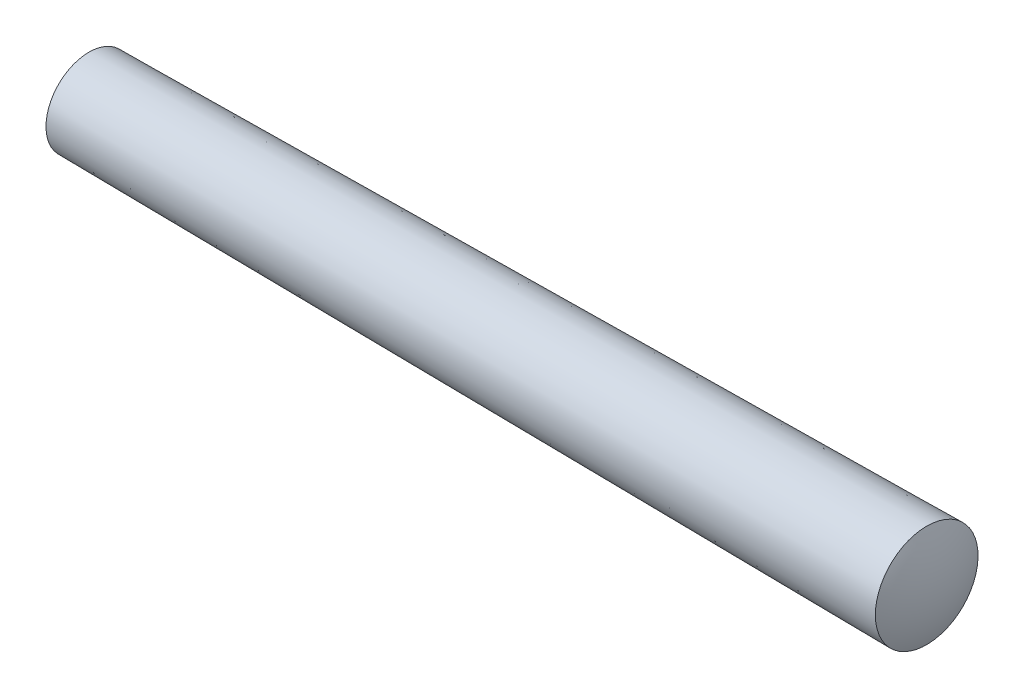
ISO-10303-21;
HEADER;
FILE_DESCRIPTION(('STEP AP214'),'2;1');
FILE_NAME('part.step','',(''),(''),'','','');
FILE_SCHEMA(('AUTOMOTIVE_DESIGN { 1 0 10303 214 1 1 1 1 }'));
ENDSEC;
DATA;
#1=APPLICATION_CONTEXT('core data for automotive mechanical design processes');
#2=APPLICATION_PROTOCOL_DEFINITION('international standard','automotive_design',2000,#1);
#3=PRODUCT_CONTEXT('',#1,'mechanical');
#4=PRODUCT('Part','Part','',(#3));
#5=PRODUCT_RELATED_PRODUCT_CATEGORY('part','',(#4));
#6=PRODUCT_DEFINITION_FORMATION('','',#4);
#7=PRODUCT_DEFINITION_CONTEXT('part definition',#1,'design');
#8=PRODUCT_DEFINITION('design','',#6,#7);
#9=PRODUCT_DEFINITION_SHAPE('','',#8);
#10=(LENGTH_UNIT() NAMED_UNIT(*) SI_UNIT(.MILLI.,.METRE.));
#11=(NAMED_UNIT(*) PLANE_ANGLE_UNIT() SI_UNIT($,.RADIAN.));
#12=(NAMED_UNIT(*) SI_UNIT($,.STERADIAN.) SOLID_ANGLE_UNIT());
#13=UNCERTAINTY_MEASURE_WITH_UNIT(LENGTH_MEASURE(1.E-05),#10,'distance_accuracy_value','');
#14=(GEOMETRIC_REPRESENTATION_CONTEXT(3) GLOBAL_UNCERTAINTY_ASSIGNED_CONTEXT((#13)) GLOBAL_UNIT_ASSIGNED_CONTEXT((#10,
#11,#12)) REPRESENTATION_CONTEXT('',''));
#15=CARTESIAN_POINT('',(0.,0.,0.));
#16=DIRECTION('',(0.,0.,1.));
#17=DIRECTION('',(1.,0.,0.));
#18=AXIS2_PLACEMENT_3D('',#15,#16,#17);
#19=CARTESIAN_POINT('',(42.6020168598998,0.,0.));
#20=DIRECTION('',(-1.,0.,0.));
#21=DIRECTION('',(0.,1.,0.));
#22=AXIS2_PLACEMENT_3D('',#19,#20,#21);
#23=SPHERICAL_SURFACE('',#22,7.39798314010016);
#24=CARTESIAN_POINT('',(49.37,0.,0.));
#25=DIRECTION('',(-1.,0.,0.));
#26=DIRECTION('',(0.,0.,1.));
#27=AXIS2_PLACEMENT_3D('',#24,#25,#26);
#28=CIRCLE('',#27,2.98739999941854);
#29=CARTESIAN_POINT('',(49.37,0.,2.98739999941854));
#30=VERTEX_POINT('',#29);
#31=EDGE_CURVE('E43',#30,#30,#28,.T.);
#32=ORIENTED_EDGE('',*,*,#31,.F.);
#33=EDGE_LOOP('',(#32));
#34=FACE_BOUND('',#33,.T.);
#35=ADVANCED_FACE('F40',(#34),#23,.T.);
#36=CARTESIAN_POINT('',(5.27531746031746,0.,0.));
#37=DIRECTION('',(-1.,0.,0.));
#38=DIRECTION('',(0.,1.,0.));
#39=AXIS2_PLACEMENT_3D('',#36,#37,#38);
#40=SPHERICAL_SURFACE('',#39,5.27531746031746);
#41=CARTESIAN_POINT('',(0.63,0.,0.));
#42=DIRECTION('',(-1.,0.,0.));
#43=DIRECTION('',(0.,0.,1.));
#44=AXIS2_PLACEMENT_3D('',#41,#42,#43);
#45=CIRCLE('',#44,2.5);
#46=CARTESIAN_POINT('',(0.63,0.,2.5));
#47=VERTEX_POINT('',#46);
#48=EDGE_CURVE('E10',#47,#47,#45,.T.);
#49=ORIENTED_EDGE('',*,*,#48,.T.);
#50=EDGE_LOOP('',(#49));
#51=FACE_BOUND('',#50,.T.);
#52=ADVANCED_FACE('F55',(#51),#40,.T.);
#53=CARTESIAN_POINT('',(49.37,0.,0.));
#54=DIRECTION('',(1.,0.,0.));
#55=DIRECTION('',(0.,0.,-1.));
#56=AXIS2_PLACEMENT_3D('',#53,#54,#55);
#57=CONICAL_SURFACE('',#56,2.98739999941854,0.00999966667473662);
#58=ORIENTED_EDGE('',*,*,#48,.F.);
#59=EDGE_LOOP('',(#58));
#60=FACE_BOUND('',#59,.T.);
#61=ORIENTED_EDGE('',*,*,#31,.T.);
#62=EDGE_LOOP('',(#61));
#63=FACE_BOUND('',#62,.T.);
#64=ADVANCED_FACE('F47',(#60,#63),#57,.T.);
#65=CLOSED_SHELL('',(#35,#52,#64));
#66=MANIFOLD_SOLID_BREP('B2',#65);
#67=ADVANCED_BREP_SHAPE_REPRESENTATION('',(#18,#66),#14);
#68=SHAPE_DEFINITION_REPRESENTATION(#9,#67);
ENDSEC;
END-ISO-10303-21;
